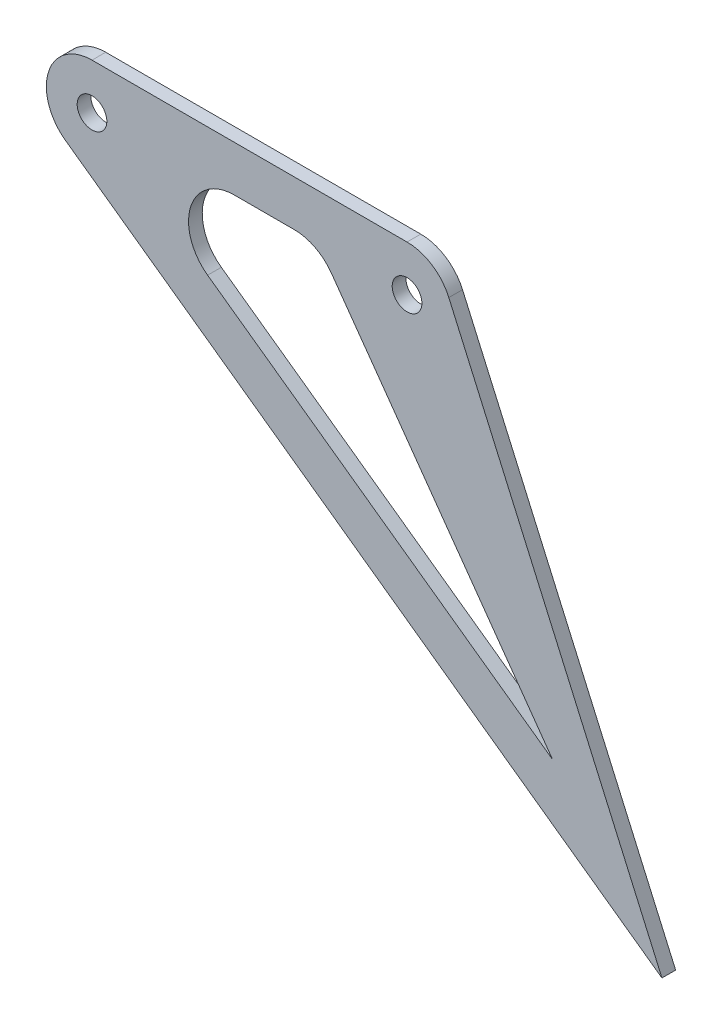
ISO-10303-21;
HEADER;
FILE_DESCRIPTION(('STEP AP214'),'2;1');
FILE_NAME('part.step','',(''),(''),'','','');
FILE_SCHEMA(('AUTOMOTIVE_DESIGN { 1 0 10303 214 1 1 1 1 }'));
ENDSEC;
DATA;
#1=APPLICATION_CONTEXT('core data for automotive mechanical design processes');
#2=APPLICATION_PROTOCOL_DEFINITION('international standard','automotive_design',2000,#1);
#3=PRODUCT_CONTEXT('',#1,'mechanical');
#4=PRODUCT('Part','Part','',(#3));
#5=PRODUCT_RELATED_PRODUCT_CATEGORY('part','',(#4));
#6=PRODUCT_DEFINITION_FORMATION('','',#4);
#7=PRODUCT_DEFINITION_CONTEXT('part definition',#1,'design');
#8=PRODUCT_DEFINITION('design','',#6,#7);
#9=PRODUCT_DEFINITION_SHAPE('','',#8);
#10=(LENGTH_UNIT() NAMED_UNIT(*) SI_UNIT(.MILLI.,.METRE.));
#11=(NAMED_UNIT(*) PLANE_ANGLE_UNIT() SI_UNIT($,.RADIAN.));
#12=(NAMED_UNIT(*) SI_UNIT($,.STERADIAN.) SOLID_ANGLE_UNIT());
#13=UNCERTAINTY_MEASURE_WITH_UNIT(LENGTH_MEASURE(1.E-05),#10,'distance_accuracy_value','');
#14=(GEOMETRIC_REPRESENTATION_CONTEXT(3) GLOBAL_UNCERTAINTY_ASSIGNED_CONTEXT((#13)) GLOBAL_UNIT_ASSIGNED_CONTEXT((#10,
#11,#12)) REPRESENTATION_CONTEXT('',''));
#15=CARTESIAN_POINT('',(0.,0.,0.));
#16=DIRECTION('',(0.,0.,1.));
#17=DIRECTION('',(1.,0.,0.));
#18=AXIS2_PLACEMENT_3D('',#15,#16,#17);
#19=CARTESIAN_POINT('',(0.,0.,3.));
#20=DIRECTION('',(0.,0.,1.));
#21=DIRECTION('',(1.,0.,0.));
#22=AXIS2_PLACEMENT_3D('',#19,#20,#21);
#23=PLANE('',#22);
#24=CARTESIAN_POINT('',(0.,0.,3.));
#25=DIRECTION('',(0.,0.,1.));
#26=DIRECTION('',(1.,0.,0.));
#27=AXIS2_PLACEMENT_3D('',#24,#25,#26);
#28=CIRCLE('',#27,3.25);
#29=CARTESIAN_POINT('',(3.25,0.,3.));
#30=VERTEX_POINT('',#29);
#31=EDGE_CURVE('E152',#30,#30,#28,.T.);
#32=ORIENTED_EDGE('',*,*,#31,.F.);
#33=EDGE_LOOP('',(#32));
#34=FACE_BOUND('',#33,.T.);
#35=DIRECTION('',(0.813048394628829,-0.582196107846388,0.));
#36=VECTOR('',#35,1.);
#37=CARTESIAN_POINT('',(124.826086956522,-101.683076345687,3.));
#38=LINE('',#37,#36);
#39=CARTESIAN_POINT('',(-5.82196107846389,-8.13048394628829,3.));
#40=VERTEX_POINT('',#39);
#41=CARTESIAN_POINT('',(124.826086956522,-101.683076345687,3.));
#42=VERTEX_POINT('',#41);
#43=EDGE_CURVE('E164',#40,#42,#38,.T.);
#44=ORIENTED_EDGE('',*,*,#43,.T.);
#45=DIRECTION('',(-0.403900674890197,0.914802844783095,0.));
#46=VECTOR('',#45,1.);
#47=CARTESIAN_POINT('',(124.826086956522,-101.683076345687,3.));
#48=LINE('',#47,#46);
#49=CARTESIAN_POINT('',(78.148028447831,4.03900674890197,3.));
#50=VERTEX_POINT('',#49);
#51=EDGE_CURVE('E167',#42,#50,#48,.T.);
#52=ORIENTED_EDGE('',*,*,#51,.T.);
#53=CARTESIAN_POINT('',(69.,0.,3.));
#54=DIRECTION('',(0.,0.,1.));
#55=DIRECTION('',(1.,0.,0.));
#56=AXIS2_PLACEMENT_3D('',#53,#54,#55);
#57=CIRCLE('',#56,9.99999999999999);
#58=CARTESIAN_POINT('',(69.,9.99999999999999,3.));
#59=VERTEX_POINT('',#58);
#60=EDGE_CURVE('E170',#50,#59,#57,.T.);
#61=ORIENTED_EDGE('',*,*,#60,.T.);
#62=DIRECTION('',(-1.,0.,0.));
#63=VECTOR('',#62,1.);
#64=CARTESIAN_POINT('',(0.,10.,3.));
#65=LINE('',#64,#63);
#66=CARTESIAN_POINT('',(0.,10.,3.));
#67=VERTEX_POINT('',#66);
#68=EDGE_CURVE('E172',#59,#67,#65,.T.);
#69=ORIENTED_EDGE('',*,*,#68,.T.);
#70=CARTESIAN_POINT('',(0.,0.,3.));
#71=DIRECTION('',(0.,0.,1.));
#72=DIRECTION('',(1.,0.,0.));
#73=AXIS2_PLACEMENT_3D('',#70,#71,#72);
#74=CIRCLE('',#73,10.);
#75=EDGE_CURVE('E174',#67,#40,#74,.T.);
#76=ORIENTED_EDGE('',*,*,#75,.T.);
#77=EDGE_LOOP('',(#44,#52,#61,#69,#76));
#78=FACE_BOUND('',#77,.T.);
#79=CARTESIAN_POINT('',(69.,0.,3.));
#80=DIRECTION('',(0.,0.,1.));
#81=DIRECTION('',(1.,0.,0.));
#82=AXIS2_PLACEMENT_3D('',#79,#80,#81);
#83=CIRCLE('',#82,3.25000000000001);
#84=CARTESIAN_POINT('',(72.25,0.,3.));
#85=VERTEX_POINT('',#84);
#86=EDGE_CURVE('E158',#85,#85,#83,.T.);
#87=ORIENTED_EDGE('',*,*,#86,.F.);
#88=EDGE_LOOP('',(#87));
#89=FACE_BOUND('',#88,.T.);
#90=CARTESIAN_POINT('',(44.296116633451,-10.,3.));
#91=DIRECTION('',(0.,0.,1.));
#92=DIRECTION('',(1.,0.,0.));
#93=AXIS2_PLACEMENT_3D('',#90,#91,#92);
#94=CIRCLE('',#93,10.);
#95=CARTESIAN_POINT('',(52.4419428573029,-4.19952457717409,3.));
#96=VERTEX_POINT('',#95);
#97=CARTESIAN_POINT('',(44.296116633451,0.,3.));
#98=VERTEX_POINT('',#97);
#99=EDGE_CURVE('E116',#96,#98,#94,.T.);
#100=ORIENTED_EDGE('',*,*,#99,.F.);
#101=DIRECTION('',(-0.580047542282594,0.814582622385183,0.));
#102=VECTOR('',#101,1.);
#103=CARTESIAN_POINT('',(52.4419428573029,-4.1995245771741,3.));
#104=LINE('',#103,#102);
#105=CARTESIAN_POINT('',(100.90004904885,-72.251069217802,3.));
#106=VERTEX_POINT('',#105);
#107=EDGE_CURVE('E108',#106,#96,#104,.T.);
#108=ORIENTED_EDGE('',*,*,#107,.F.);
#109=DIRECTION('',(0.813048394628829,-0.582196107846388,0.));
#110=VECTOR('',#109,1.);
#111=CARTESIAN_POINT('',(100.90004904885,-72.251069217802,3.));
#112=LINE('',#111,#110);
#113=CARTESIAN_POINT('',(25.3195798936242,-18.1304839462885,3.));
#114=VERTEX_POINT('',#113);
#115=EDGE_CURVE('E135',#114,#106,#112,.T.);
#116=ORIENTED_EDGE('',*,*,#115,.F.);
#117=CARTESIAN_POINT('',(31.1415409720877,-10.,3.));
#118=DIRECTION('',(0.,0.,1.));
#119=DIRECTION('',(-1.,0.,0.));
#120=AXIS2_PLACEMENT_3D('',#117,#118,#119);
#121=CIRCLE('',#120,10.);
#122=CARTESIAN_POINT('',(31.1415409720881,0.,3.));
#123=VERTEX_POINT('',#122);
#124=EDGE_CURVE('E131',#123,#114,#121,.T.);
#125=ORIENTED_EDGE('',*,*,#124,.F.);
#126=DIRECTION('',(-1.,0.,0.));
#127=VECTOR('',#126,1.);
#128=CARTESIAN_POINT('',(31.1415409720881,0.,3.));
#129=LINE('',#128,#127);
#130=EDGE_CURVE('E129',#98,#123,#129,.T.);
#131=ORIENTED_EDGE('',*,*,#130,.F.);
#132=EDGE_LOOP('',(#100,#108,#116,#125,#131));
#133=FACE_BOUND('',#132,.T.);
#134=ADVANCED_FACE('F31',(#34,#78,#89,#133),#23,.T.);
#135=CARTESIAN_POINT('',(0.,0.,0.));
#136=DIRECTION('',(0.,0.,1.));
#137=DIRECTION('',(1.,0.,0.));
#138=AXIS2_PLACEMENT_3D('',#135,#136,#137);
#139=PLANE('',#138);
#140=CARTESIAN_POINT('',(0.,0.,0.));
#141=DIRECTION('',(0.,0.,1.));
#142=DIRECTION('',(1.,0.,0.));
#143=AXIS2_PLACEMENT_3D('',#140,#141,#142);
#144=CIRCLE('',#143,3.25);
#145=CARTESIAN_POINT('',(3.25,0.,0.));
#146=VERTEX_POINT('',#145);
#147=EDGE_CURVE('E124',#146,#146,#144,.T.);
#148=ORIENTED_EDGE('',*,*,#147,.T.);
#149=EDGE_LOOP('',(#148));
#150=FACE_BOUND('',#149,.T.);
#151=DIRECTION('',(0.813048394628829,-0.582196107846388,0.));
#152=VECTOR('',#151,1.);
#153=CARTESIAN_POINT('',(124.826086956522,-101.683076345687,0.));
#154=LINE('',#153,#152);
#155=CARTESIAN_POINT('',(-5.82196107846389,-8.13048394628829,0.));
#156=VERTEX_POINT('',#155);
#157=CARTESIAN_POINT('',(124.826086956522,-101.683076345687,0.));
#158=VERTEX_POINT('',#157);
#159=EDGE_CURVE('E161',#156,#158,#154,.T.);
#160=ORIENTED_EDGE('',*,*,#159,.F.);
#161=CARTESIAN_POINT('',(0.,0.,0.));
#162=DIRECTION('',(0.,0.,1.));
#163=DIRECTION('',(1.,0.,0.));
#164=AXIS2_PLACEMENT_3D('',#161,#162,#163);
#165=CIRCLE('',#164,10.);
#166=CARTESIAN_POINT('',(0.,10.,0.));
#167=VERTEX_POINT('',#166);
#168=EDGE_CURVE('E168',#167,#156,#165,.T.);
#169=ORIENTED_EDGE('',*,*,#168,.F.);
#170=DIRECTION('',(-1.,0.,0.));
#171=VECTOR('',#170,1.);
#172=CARTESIAN_POINT('',(0.,10.,0.));
#173=LINE('',#172,#171);
#174=CARTESIAN_POINT('',(69.,9.99999999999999,0.));
#175=VERTEX_POINT('',#174);
#176=EDGE_CURVE('E183',#175,#167,#173,.T.);
#177=ORIENTED_EDGE('',*,*,#176,.F.);
#178=CARTESIAN_POINT('',(69.,0.,0.));
#179=DIRECTION('',(0.,0.,1.));
#180=DIRECTION('',(1.,0.,0.));
#181=AXIS2_PLACEMENT_3D('',#178,#179,#180);
#182=CIRCLE('',#181,9.99999999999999);
#183=CARTESIAN_POINT('',(78.148028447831,4.03900674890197,0.));
#184=VERTEX_POINT('',#183);
#185=EDGE_CURVE('E181',#184,#175,#182,.T.);
#186=ORIENTED_EDGE('',*,*,#185,.F.);
#187=DIRECTION('',(-0.403900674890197,0.914802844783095,0.));
#188=VECTOR('',#187,1.);
#189=CARTESIAN_POINT('',(124.826086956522,-101.683076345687,0.));
#190=LINE('',#189,#188);
#191=EDGE_CURVE('E179',#158,#184,#190,.T.);
#192=ORIENTED_EDGE('',*,*,#191,.F.);
#193=EDGE_LOOP('',(#160,#169,#177,#186,#192));
#194=FACE_BOUND('',#193,.T.);
#195=CARTESIAN_POINT('',(69.,0.,0.));
#196=DIRECTION('',(0.,0.,1.));
#197=DIRECTION('',(1.,0.,0.));
#198=AXIS2_PLACEMENT_3D('',#195,#196,#197);
#199=CIRCLE('',#198,3.25000000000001);
#200=CARTESIAN_POINT('',(72.25,0.,0.));
#201=VERTEX_POINT('',#200);
#202=EDGE_CURVE('E155',#201,#201,#199,.T.);
#203=ORIENTED_EDGE('',*,*,#202,.T.);
#204=EDGE_LOOP('',(#203));
#205=FACE_BOUND('',#204,.T.);
#206=DIRECTION('',(-0.580047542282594,0.814582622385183,0.));
#207=VECTOR('',#206,1.);
#208=CARTESIAN_POINT('',(52.4419428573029,-4.1995245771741,0.));
#209=LINE('',#208,#207);
#210=CARTESIAN_POINT('',(100.90004904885,-72.251069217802,0.));
#211=VERTEX_POINT('',#210);
#212=CARTESIAN_POINT('',(52.4419428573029,-4.19952457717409,0.));
#213=VERTEX_POINT('',#212);
#214=EDGE_CURVE('E54',#211,#213,#209,.T.);
#215=ORIENTED_EDGE('',*,*,#214,.T.);
#216=CARTESIAN_POINT('',(44.296116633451,-10.,0.));
#217=DIRECTION('',(0.,0.,1.));
#218=DIRECTION('',(1.,0.,0.));
#219=AXIS2_PLACEMENT_3D('',#216,#217,#218);
#220=CIRCLE('',#219,10.);
#221=CARTESIAN_POINT('',(44.296116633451,0.,0.));
#222=VERTEX_POINT('',#221);
#223=EDGE_CURVE('E123',#213,#222,#220,.T.);
#224=ORIENTED_EDGE('',*,*,#223,.T.);
#225=DIRECTION('',(-1.,0.,0.));
#226=VECTOR('',#225,1.);
#227=CARTESIAN_POINT('',(31.1415409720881,0.,0.));
#228=LINE('',#227,#226);
#229=CARTESIAN_POINT('',(31.1415409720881,0.,0.));
#230=VERTEX_POINT('',#229);
#231=EDGE_CURVE('E139',#222,#230,#228,.T.);
#232=ORIENTED_EDGE('',*,*,#231,.T.);
#233=CARTESIAN_POINT('',(31.1415409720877,-10.,0.));
#234=DIRECTION('',(0.,0.,1.));
#235=DIRECTION('',(-1.,0.,0.));
#236=AXIS2_PLACEMENT_3D('',#233,#234,#235);
#237=CIRCLE('',#236,10.);
#238=CARTESIAN_POINT('',(25.3195798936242,-18.1304839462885,0.));
#239=VERTEX_POINT('',#238);
#240=EDGE_CURVE('E142',#230,#239,#237,.T.);
#241=ORIENTED_EDGE('',*,*,#240,.T.);
#242=DIRECTION('',(0.813048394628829,-0.582196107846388,0.));
#243=VECTOR('',#242,1.);
#244=CARTESIAN_POINT('',(100.90004904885,-72.251069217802,0.));
#245=LINE('',#244,#243);
#246=EDGE_CURVE('E117',#239,#211,#245,.T.);
#247=ORIENTED_EDGE('',*,*,#246,.T.);
#248=EDGE_LOOP('',(#215,#224,#232,#241,#247));
#249=FACE_BOUND('',#248,.T.);
#250=ADVANCED_FACE('F204',(#150,#194,#205,#249),#139,.F.);
#251=CARTESIAN_POINT('',(124.826086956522,-101.683076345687,3.));
#252=DIRECTION('',(0.582196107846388,0.813048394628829,0.));
#253=DIRECTION('',(-0.81304839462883,0.582196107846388,0.));
#254=AXIS2_PLACEMENT_3D('',#251,#252,#253);
#255=PLANE('',#254);
#256=ORIENTED_EDGE('',*,*,#159,.T.);
#257=DIRECTION('',(0.,0.,-1.));
#258=VECTOR('',#257,1.);
#259=CARTESIAN_POINT('',(124.826086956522,-101.683076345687,3.));
#260=LINE('',#259,#258);
#261=EDGE_CURVE('E11',#42,#158,#260,.T.);
#262=ORIENTED_EDGE('',*,*,#261,.F.);
#263=ORIENTED_EDGE('',*,*,#43,.F.);
#264=DIRECTION('',(0.,0.,-1.));
#265=VECTOR('',#264,1.);
#266=CARTESIAN_POINT('',(-5.82196107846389,-8.13048394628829,3.));
#267=LINE('',#266,#265);
#268=EDGE_CURVE('E176',#40,#156,#267,.T.);
#269=ORIENTED_EDGE('',*,*,#268,.T.);
#270=EDGE_LOOP('',(#256,#262,#263,#269));
#271=FACE_BOUND('',#270,.T.);
#272=ADVANCED_FACE('F33',(#271),#255,.F.);
#273=CARTESIAN_POINT('',(124.826086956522,-101.683076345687,3.));
#274=DIRECTION('',(-0.914802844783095,-0.403900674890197,0.));
#275=DIRECTION('',(0.403900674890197,-0.914802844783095,0.));
#276=AXIS2_PLACEMENT_3D('',#273,#274,#275);
#277=PLANE('',#276);
#278=ORIENTED_EDGE('',*,*,#191,.T.);
#279=DIRECTION('',(0.,0.,-1.));
#280=VECTOR('',#279,1.);
#281=CARTESIAN_POINT('',(78.148028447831,4.03900674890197,3.));
#282=LINE('',#281,#280);
#283=EDGE_CURVE('E39',#50,#184,#282,.T.);
#284=ORIENTED_EDGE('',*,*,#283,.F.);
#285=ORIENTED_EDGE('',*,*,#51,.F.);
#286=ORIENTED_EDGE('',*,*,#261,.T.);
#287=EDGE_LOOP('',(#278,#284,#285,#286));
#288=FACE_BOUND('',#287,.T.);
#289=ADVANCED_FACE('F219',(#288),#277,.F.);
#290=CARTESIAN_POINT('',(69.,0.,3.));
#291=DIRECTION('',(0.,0.,-1.));
#292=DIRECTION('',(-1.,0.,0.));
#293=AXIS2_PLACEMENT_3D('',#290,#291,#292);
#294=CYLINDRICAL_SURFACE('',#293,9.99999999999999);
#295=ORIENTED_EDGE('',*,*,#185,.T.);
#296=DIRECTION('',(0.,0.,-1.));
#297=VECTOR('',#296,1.);
#298=CARTESIAN_POINT('',(69.,9.99999999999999,3.));
#299=LINE('',#298,#297);
#300=EDGE_CURVE('E191',#59,#175,#299,.T.);
#301=ORIENTED_EDGE('',*,*,#300,.F.);
#302=ORIENTED_EDGE('',*,*,#60,.F.);
#303=ORIENTED_EDGE('',*,*,#283,.T.);
#304=EDGE_LOOP('',(#295,#301,#302,#303));
#305=FACE_BOUND('',#304,.T.);
#306=ADVANCED_FACE('F198',(#305),#294,.T.);
#307=CARTESIAN_POINT('',(0.,10.,3.));
#308=DIRECTION('',(0.,-1.,0.));
#309=DIRECTION('',(0.,0.,-1.));
#310=AXIS2_PLACEMENT_3D('',#307,#308,#309);
#311=PLANE('',#310);
#312=ORIENTED_EDGE('',*,*,#176,.T.);
#313=DIRECTION('',(0.,0.,-1.));
#314=VECTOR('',#313,1.);
#315=CARTESIAN_POINT('',(0.,10.,3.));
#316=LINE('',#315,#314);
#317=EDGE_CURVE('E188',#67,#167,#316,.T.);
#318=ORIENTED_EDGE('',*,*,#317,.F.);
#319=ORIENTED_EDGE('',*,*,#68,.F.);
#320=ORIENTED_EDGE('',*,*,#300,.T.);
#321=EDGE_LOOP('',(#312,#318,#319,#320));
#322=FACE_BOUND('',#321,.T.);
#323=ADVANCED_FACE('F209',(#322),#311,.F.);
#324=CARTESIAN_POINT('',(0.,0.,3.));
#325=DIRECTION('',(0.,0.,-1.));
#326=DIRECTION('',(-1.,0.,0.));
#327=AXIS2_PLACEMENT_3D('',#324,#325,#326);
#328=CYLINDRICAL_SURFACE('',#327,10.);
#329=ORIENTED_EDGE('',*,*,#168,.T.);
#330=ORIENTED_EDGE('',*,*,#268,.F.);
#331=ORIENTED_EDGE('',*,*,#75,.F.);
#332=ORIENTED_EDGE('',*,*,#317,.T.);
#333=EDGE_LOOP('',(#329,#330,#331,#332));
#334=FACE_BOUND('',#333,.T.);
#335=ADVANCED_FACE('F213',(#334),#328,.T.);
#336=CARTESIAN_POINT('',(69.,0.,3.));
#337=DIRECTION('',(0.,0.,-1.));
#338=DIRECTION('',(-1.,0.,0.));
#339=AXIS2_PLACEMENT_3D('',#336,#337,#338);
#340=CYLINDRICAL_SURFACE('',#339,3.25000000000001);
#341=ORIENTED_EDGE('',*,*,#86,.T.);
#342=EDGE_LOOP('',(#341));
#343=FACE_BOUND('',#342,.T.);
#344=ORIENTED_EDGE('',*,*,#202,.F.);
#345=EDGE_LOOP('',(#344));
#346=FACE_BOUND('',#345,.T.);
#347=ADVANCED_FACE('F235',(#343,#346),#340,.F.);
#348=CARTESIAN_POINT('',(0.,0.,3.));
#349=DIRECTION('',(0.,0.,-1.));
#350=DIRECTION('',(-1.,0.,0.));
#351=AXIS2_PLACEMENT_3D('',#348,#349,#350);
#352=CYLINDRICAL_SURFACE('',#351,3.25);
#353=ORIENTED_EDGE('',*,*,#31,.T.);
#354=EDGE_LOOP('',(#353));
#355=FACE_BOUND('',#354,.T.);
#356=ORIENTED_EDGE('',*,*,#147,.F.);
#357=EDGE_LOOP('',(#356));
#358=FACE_BOUND('',#357,.T.);
#359=ADVANCED_FACE('F261',(#355,#358),#352,.F.);
#360=CARTESIAN_POINT('',(52.4419428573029,-4.1995245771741,3.));
#361=DIRECTION('',(-0.814582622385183,-0.580047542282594,0.));
#362=DIRECTION('',(0.580047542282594,-0.814582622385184,0.));
#363=AXIS2_PLACEMENT_3D('',#360,#361,#362);
#364=PLANE('',#363);
#365=ORIENTED_EDGE('',*,*,#214,.F.);
#366=DIRECTION('',(0.,0.,-1.));
#367=VECTOR('',#366,1.);
#368=CARTESIAN_POINT('',(100.90004904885,-72.251069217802,3.));
#369=LINE('',#368,#367);
#370=EDGE_CURVE('E112',#106,#211,#369,.T.);
#371=ORIENTED_EDGE('',*,*,#370,.F.);
#372=ORIENTED_EDGE('',*,*,#107,.T.);
#373=DIRECTION('',(0.,0.,-1.));
#374=VECTOR('',#373,1.);
#375=CARTESIAN_POINT('',(52.4419428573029,-4.19952457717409,3.));
#376=LINE('',#375,#374);
#377=EDGE_CURVE('E111',#96,#213,#376,.T.);
#378=ORIENTED_EDGE('',*,*,#377,.T.);
#379=EDGE_LOOP('',(#365,#371,#372,#378));
#380=FACE_BOUND('',#379,.T.);
#381=ADVANCED_FACE('F110',(#380),#364,.T.);
#382=CARTESIAN_POINT('',(44.296116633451,-10.,3.));
#383=DIRECTION('',(0.,0.,-1.));
#384=DIRECTION('',(-1.,0.,0.));
#385=AXIS2_PLACEMENT_3D('',#382,#383,#384);
#386=CYLINDRICAL_SURFACE('',#385,10.);
#387=ORIENTED_EDGE('',*,*,#223,.F.);
#388=ORIENTED_EDGE('',*,*,#377,.F.);
#389=ORIENTED_EDGE('',*,*,#99,.T.);
#390=DIRECTION('',(0.,0.,-1.));
#391=VECTOR('',#390,1.);
#392=CARTESIAN_POINT('',(44.296116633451,0.,3.));
#393=LINE('',#392,#391);
#394=EDGE_CURVE('E125',#98,#222,#393,.T.);
#395=ORIENTED_EDGE('',*,*,#394,.T.);
#396=EDGE_LOOP('',(#387,#388,#389,#395));
#397=FACE_BOUND('',#396,.T.);
#398=ADVANCED_FACE('F120',(#397),#386,.F.);
#399=CARTESIAN_POINT('',(31.1415409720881,0.,3.));
#400=DIRECTION('',(0.,-1.,0.));
#401=DIRECTION('',(1.,0.,0.));
#402=AXIS2_PLACEMENT_3D('',#399,#400,#401);
#403=PLANE('',#402);
#404=ORIENTED_EDGE('',*,*,#231,.F.);
#405=ORIENTED_EDGE('',*,*,#394,.F.);
#406=ORIENTED_EDGE('',*,*,#130,.T.);
#407=DIRECTION('',(0.,0.,-1.));
#408=VECTOR('',#407,1.);
#409=CARTESIAN_POINT('',(31.1415409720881,0.,3.));
#410=LINE('',#409,#408);
#411=EDGE_CURVE('E149',#123,#230,#410,.T.);
#412=ORIENTED_EDGE('',*,*,#411,.T.);
#413=EDGE_LOOP('',(#404,#405,#406,#412));
#414=FACE_BOUND('',#413,.T.);
#415=ADVANCED_FACE('F280',(#414),#403,.T.);
#416=CARTESIAN_POINT('',(31.1415409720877,-10.,3.));
#417=DIRECTION('',(0.,0.,-1.));
#418=DIRECTION('',(-1.,0.,0.));
#419=AXIS2_PLACEMENT_3D('',#416,#417,#418);
#420=CYLINDRICAL_SURFACE('',#419,10.);
#421=ORIENTED_EDGE('',*,*,#240,.F.);
#422=ORIENTED_EDGE('',*,*,#411,.F.);
#423=ORIENTED_EDGE('',*,*,#124,.T.);
#424=DIRECTION('',(0.,0.,-1.));
#425=VECTOR('',#424,1.);
#426=CARTESIAN_POINT('',(25.3195798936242,-18.1304839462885,3.));
#427=LINE('',#426,#425);
#428=EDGE_CURVE('E46',#114,#239,#427,.T.);
#429=ORIENTED_EDGE('',*,*,#428,.T.);
#430=EDGE_LOOP('',(#421,#422,#423,#429));
#431=FACE_BOUND('',#430,.T.);
#432=ADVANCED_FACE('F287',(#431),#420,.F.);
#433=CARTESIAN_POINT('',(100.90004904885,-72.251069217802,3.));
#434=DIRECTION('',(0.582196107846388,0.813048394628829,0.));
#435=DIRECTION('',(-0.813048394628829,0.582196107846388,0.));
#436=AXIS2_PLACEMENT_3D('',#433,#434,#435);
#437=PLANE('',#436);
#438=ORIENTED_EDGE('',*,*,#246,.F.);
#439=ORIENTED_EDGE('',*,*,#428,.F.);
#440=ORIENTED_EDGE('',*,*,#115,.T.);
#441=ORIENTED_EDGE('',*,*,#370,.T.);
#442=EDGE_LOOP('',(#438,#439,#440,#441));
#443=FACE_BOUND('',#442,.T.);
#444=ADVANCED_FACE('F295',(#443),#437,.T.);
#445=CLOSED_SHELL('',(#134,#250,#272,#289,#306,#323,#335,#347,#359,#381,#398,#415,#432,#444));
#446=MANIFOLD_SOLID_BREP('B2',#445);
#447=ADVANCED_BREP_SHAPE_REPRESENTATION('',(#18,#446),#14);
#448=SHAPE_DEFINITION_REPRESENTATION(#9,#447);
ENDSEC;
END-ISO-10303-21;
